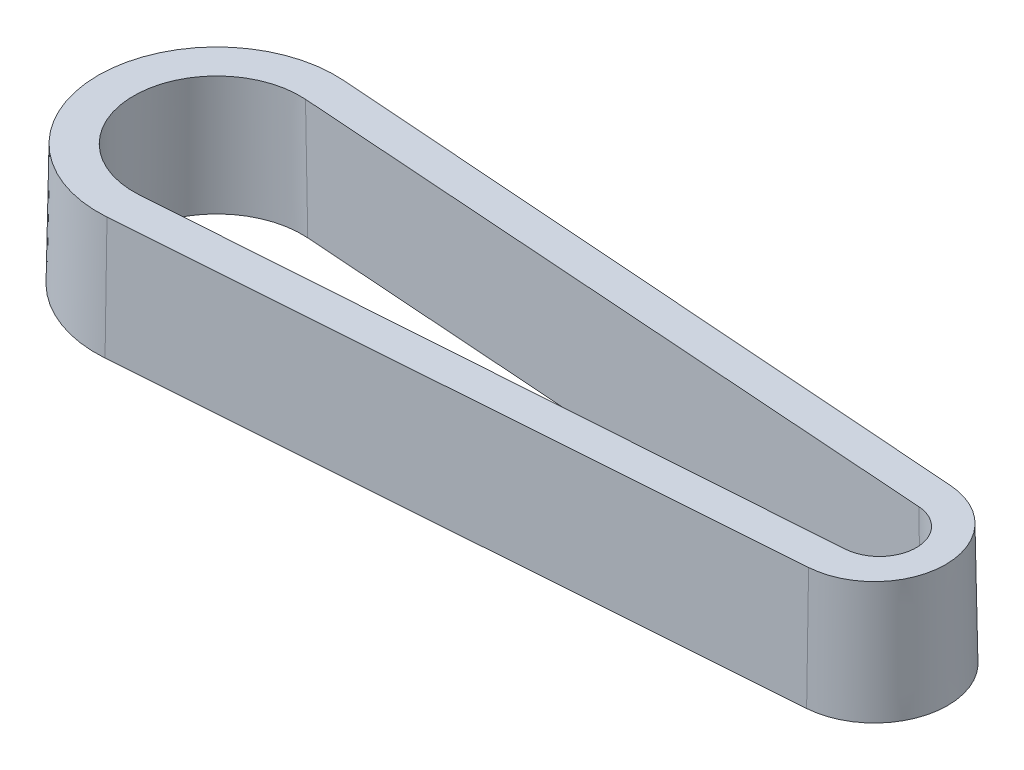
from build123d import *

# Parameters (mm, degrees)
BOSS_EXTRUDE1_DEPTH = 11.43
DRAFT1_ANGLE        = 1
DRAFT4_ANGLE        = -1


with BuildPart() as part:
    # Sketch1 → Boss-Extrude1 (new body)
    with BuildSketch(Plane(origin=(0, 0, 0), x_dir=(1, 0, 0), z_dir=(0, 1, 0))):
        with BuildLine():
            Line((0.823108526, 11.374857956), (62.615248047, 6.903449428))
            ThreePointArc((62.615248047, 6.903449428), (69.0372, 0), (62.615248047, -6.903449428))
            Line((62.615248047, -6.903449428), (0.823108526, -11.374857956))
            ThreePointArc((0.823108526, -11.374857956), (-11.4046, 0), (0.823108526, 11.374857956))
        make_face()
        with BuildLine():
            Line((0.562057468, 8.032158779), (62.842692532, 3.674015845))
            ThreePointArc((62.842692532, 3.674015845), (66.2686, 0), (62.842692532, -3.674015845))
            Line((62.842692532, -3.674015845), (0.562057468, -8.032158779))
            ThreePointArc((0.562057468, -8.032158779), (-8.0518, 0), (0.562057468, 8.032158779))
        make_face(mode=Mode.SUBTRACT)
    extrude(amount=BOSS_EXTRUDE1_DEPTH)

    # Draft1
    draft1_faces = [part.faces().sort_by_distance(p)[0] for p in [
        (66.2686, 5.715, 0),
        (31.702375, 5.715, 5.853087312),
        (-8.0518, 5.715, 0),
        (31.702375, 5.715, -5.853087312),
    ]]
    draft(draft1_faces, Plane(origin=(0, 0, 0), x_dir=(0, 0, -1), z_dir=(0, -1, 0)), DRAFT1_ANGLE)

    # Draft4
    draft4_faces = [part.faces().sort_by_distance(p)[0] for p in [
        (-11.4046, 5.715, 0),
        (69.0372, 5.715, 0),
        (31.719178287, 5.715, -9.139153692),
        (31.719178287, 5.715, 9.139153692),
    ]]
    draft(draft4_faces, Plane(origin=(0, 0, 0), x_dir=(0, 0, -1), z_dir=(0, -1, 0)), DRAFT4_ANGLE)


solid = part.part
